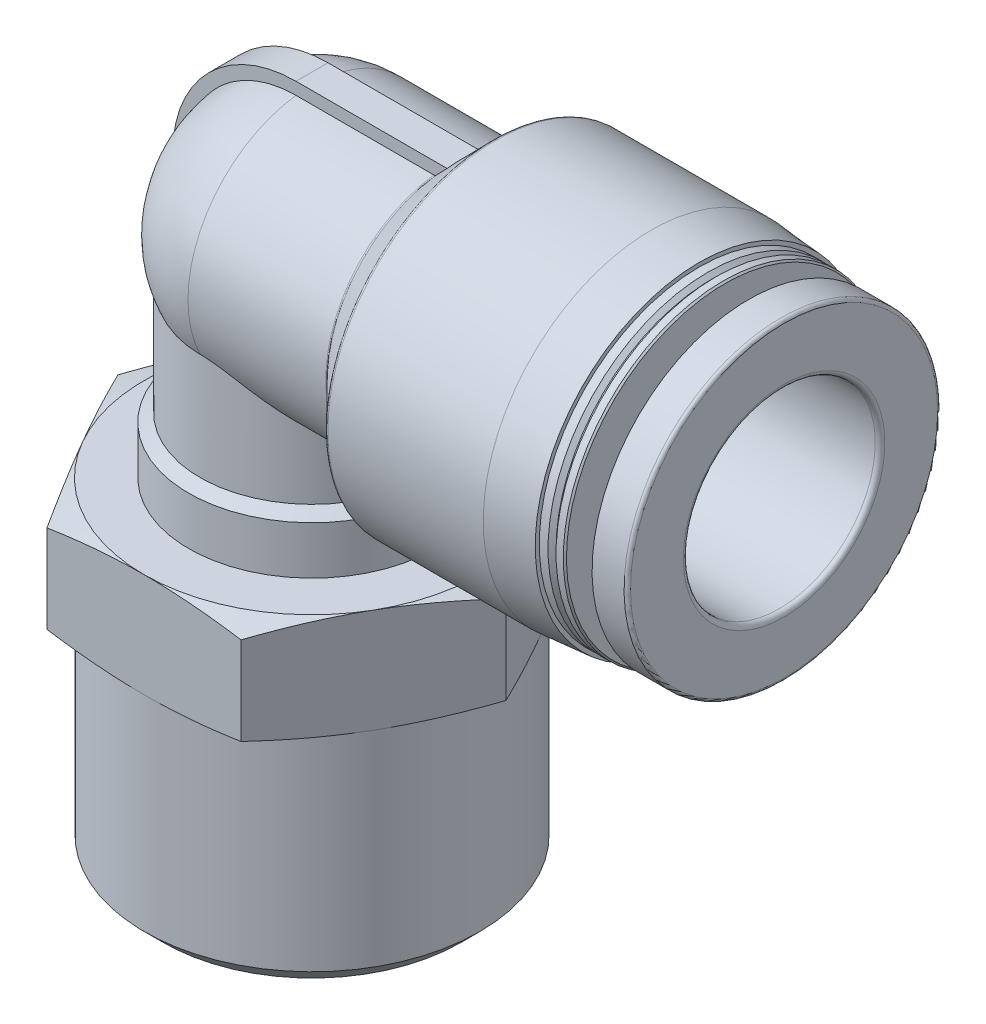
from build123d import *

# Parameters (mm, degrees)
EXTRUDE_1_DEPTH      = 1
EXTRUDE_1_DEPTH_BACK = 1
SKETCH_6_R           = 21
CUT_EXTRUDE_1_DEPTH  = 9.5


with BuildPart() as part:
    # Sketch 1 → Revolve 1 (revolve)
    with BuildSketch(Plane.XY, mode=Mode.PRIVATE) as revolve_1_sk:
        with BuildLine():
            Line((-7, 0), (-7, 0.75))
            ThreePointArc((-7, 0.75), (-4.949747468, 5.699747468), (0, 7.75))
            Line((0, 7.75), (8.613715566, 7.75))
            ThreePointArc((8.613715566, 7.75), (8.691057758, 7.765559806), (8.756365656, 7.809818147))
            Line((8.756365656, 7.809818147), (11.341216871, 10.440181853))
            ThreePointArc((11.341216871, 10.440181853), (11.406524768, 10.484440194), (11.48386696, 10.5))
            Line((11.48386696, 10.5), (21.2, 10.5))
            Line((21.2, 10.5), (24.2, 10.25))
            Line((24.2, 10.25), (24.2, 10))
            Line((24.2, 10), (24.75, 10))
            Line((24.75, 10), (25, 9.75))
            Line((25, 9.75), (25.25, 10))
            Line((25.25, 10), (25.7, 10))
            Line((25.7, 10), (25.8, 9.9))
            Line((25.8, 9.9), (25.8, 7.45))
            Line((25.8, 7.45), (27.3, 7.45))
            Line((27.3, 7.45), (27.3, 9.8))
            Line((27.3, 9.8), (29.3, 9.8))
            ThreePointArc((29.3, 9.8), (29.441421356, 9.741421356), (29.5, 9.6))
            Line((29.5, 9.6), (29.5, 0))
            Line((29.5, 0), (-7, 0))
        make_face()
    revolve(revolve_1_sk.sketch.rotate(Axis((29.5, 0, 0), (-1, 0, 0)), 180), axis=Axis((29.5, 0, 0), (-1, 0, 0)))

    # Sketch 2 → Revolve 2 (revolve)
    with BuildSketch(Plane.XY, mode=Mode.PRIVATE) as revolve_2_sk:
        Polygon((0, -34), (-9.3155, -34), (-10.4775, -32.838), (-10.4775, -20), (-10.5, -20), (-12.124355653, -19.5), (-12.124355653, -14), (-10.5, -13.5), (-7.7, -13.5), (-7.7, -10.5), (-7, -10), (-7, -1.6), (0, -1.6), align=None)
    revolve(revolve_2_sk.sketch.rotate(Axis((0, -1.6, 0), (0, -1, 0)), 180), axis=Axis((0, -1.6, 0), (0, -1, 0)))

    # Sketch 3 → Extrude 1 (add, two sides: drawn at the far end of the back side and taken through both)
    with BuildSketch(Plane.XY.offset(-EXTRUDE_1_DEPTH_BACK)):
        with BuildLine():
            Line((-7.7, 0.75), (-7.7, -10.5))
            Line((-7.7, -10.5), (0, -10.5))
            Line((0, -10.5), (0, 0))
            Line((0, 0), (10.4, 0))
            Line((10.4, 0), (10.4, 8.45))
            Line((10.4, 8.45), (0, 8.45))
            ThreePointArc((0, 8.45), (-5.444722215, 6.194722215), (-7.7, 0.75))
        make_face()
    extrude(amount=EXTRUDE_1_DEPTH + EXTRUDE_1_DEPTH_BACK)

    # Sketch 4 → Cut-Revolve 1 (revolve, cut)
    with BuildSketch(Plane.XY, mode=Mode.PRIVATE) as cut_revolve_1_sk:
        with BuildLine():
            Line((0, 0), (0, 5))
            Line((0, 5), (6.3, 5))
            ThreePointArc((6.3, 5), (6.441421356, 5.058578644), (6.5, 5.2))
            Line((6.5, 5.2), (6.5, 5.8))
            ThreePointArc((6.5, 5.8), (6.558578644, 5.941421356), (6.7, 6))
            Line((6.7, 6), (29.2, 6))
            ThreePointArc((29.2, 6), (29.412132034, 6.087867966), (29.5, 6.3))
            Line((29.5, 6.3), (29.5, 0))
            Line((29.5, 0), (0, 0))
        make_face()
    revolve(cut_revolve_1_sk.sketch.rotate(Axis((29.5, 0, 0), (-1, 0, 0)), 270), axis=Axis((29.5, 0, 0), (-1, 0, 0)), mode=Mode.SUBTRACT)

    # Sketch 5 → Cut-Revolve 2 (revolve, cut)
    with BuildSketch(Plane.XY, mode=Mode.PRIVATE) as cut_revolve_2_sk:
        with BuildLine():
            Line((0, -34), (-5.8, -34))
            Line((-5.8, -34), (-5.5, -33.7))
            Line((-5.5, -33.7), (-5.5, -20.7))
            Line((-5.5, -20.7), (-5, -20.7))
            Line((-5, -20.7), (-5, 0))
            ThreePointArc((-5, 0), (-3.535533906, 3.535533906), (0, 5))
            Line((0, 5), (0, -34))
        make_face()
    revolve(cut_revolve_2_sk.sketch.rotate(Axis((0, 5, 0), (0, -1, 0)), 90), axis=Axis((0, 5, 0), (0, -1, 0)), mode=Mode.SUBTRACT)

    # Sketch 6 → Cut-Extrude 1 (cut)
    with BuildSketch(Plane(origin=(0, -20, 0), x_dir=(1, 0, 0), z_dir=(0, 1, 0))):
        Circle(SKETCH_6_R)
        Polygon((-12.124355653, 0), (-6.062177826, -10.5), (6.062177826, -10.5), (12.124355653, 0), (6.062177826, 10.5), (-6.062177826, 10.5), align=None, mode=Mode.SUBTRACT)
    extrude(amount=CUT_EXTRUDE_1_DEPTH, mode=Mode.SUBTRACT)


solid = part.part
